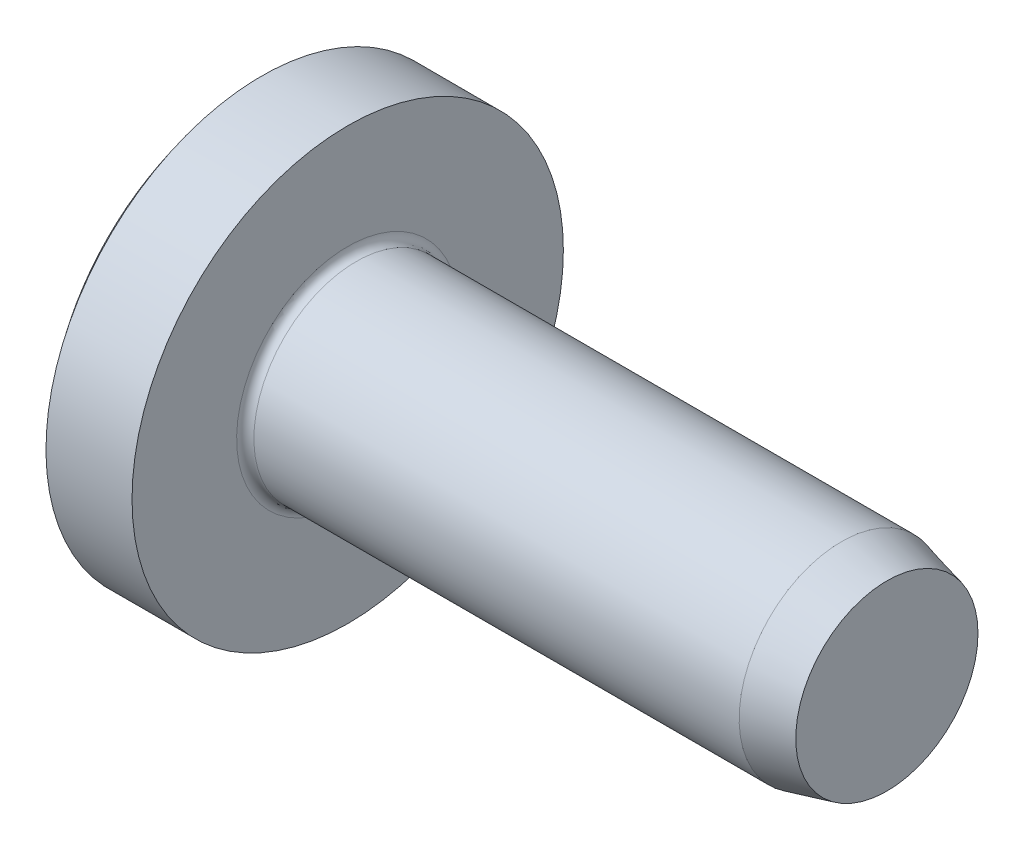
from build123d import *

# Parameters (mm, degrees)
CROSSRECESS_DEPTH = 5.2
FILLET1_R         = 0.4
DRAFT1_ANGLE      = -30


with BuildPart() as part:
    # Sketch1 → Base (revolve)
    with BuildSketch(Plane.XY, mode=Mode.PRIVATE) as base_sk:
        with BuildLine():
            Line((32.5, 0), (32.5, 4.75))
            Line((32.5, 4.75), (7.5, 4.75))
            Line((7.5, 4.75), (7.5, 10))
            Line((7.5, 10), (3.510004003, 10))
            ThreePointArc((3.510004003, 10), (0.902981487, 5.299059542), (0, 0))
            Line((0, 0), (32.5, 0))
        make_face()
    revolve(base_sk.sketch.rotate(Axis((-65.54753617, 0, 0), (1, 0, 0)), 180), axis=Axis((-65.54753617, 0, 0), (1, 0, 0)))

    # Sketch2 → CrossRecess (cut)
    with BuildSketch(Plane(origin=(0, 0, 0), x_dir=(0, 0, -1), z_dir=(1, 0, 0))):
        Polygon((-1.01, 5.05), (1.01, 5.05), (1.01, 1.01), (5.05, 1.01), (5.05, -1.01), (1.01, -1.01), (1.01, -5.05), (-1.01, -5.05), (-1.01, -1.01), (-5.05, -1.01), (-5.05, 1.01), (-1.01, 1.01), align=None)
    extrude(amount=CROSSRECESS_DEPTH, mode=Mode.SUBTRACT)

    # Fillet1
    fillet1_edges = [part.edges().sort_by_distance(p)[0] for p in [
        (7.5, 4.75, 0),
    ]]
    fillet(fillet1_edges, radius=FILLET1_R)

    # Sketch4 → Cut-Revolve1 (revolve, cut)
    with BuildSketch(Plane.XY, mode=Mode.PRIVATE) as cut_revolve1_sk:
        Polygon((28.3, -4.75), (30.4, -4.75), (32.5, -4.225), (32.5, -5.25), (28.3, -5.25), align=None)
    revolve(cut_revolve1_sk.sketch.rotate(Axis((1.328193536, 0, 0), (-1, 0, 0)), 270), axis=Axis((1.328193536, 0, 0), (-1, 0, 0)), mode=Mode.SUBTRACT)

    # Draft1
    draft1_faces = [part.faces().sort_by_distance(p)[0] for p in [
        (3.014519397, -5.05, 0),
        (3.014519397, 0, 5.05),
        (3.014519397, 5.05, 0),
        (3.014519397, 0, -5.05),
    ]]
    draft(draft1_faces, Plane(origin=(0, 0, 0), x_dir=(0, 0, 1), z_dir=(1, 0, 0)), DRAFT1_ANGLE)


solid = part.part
